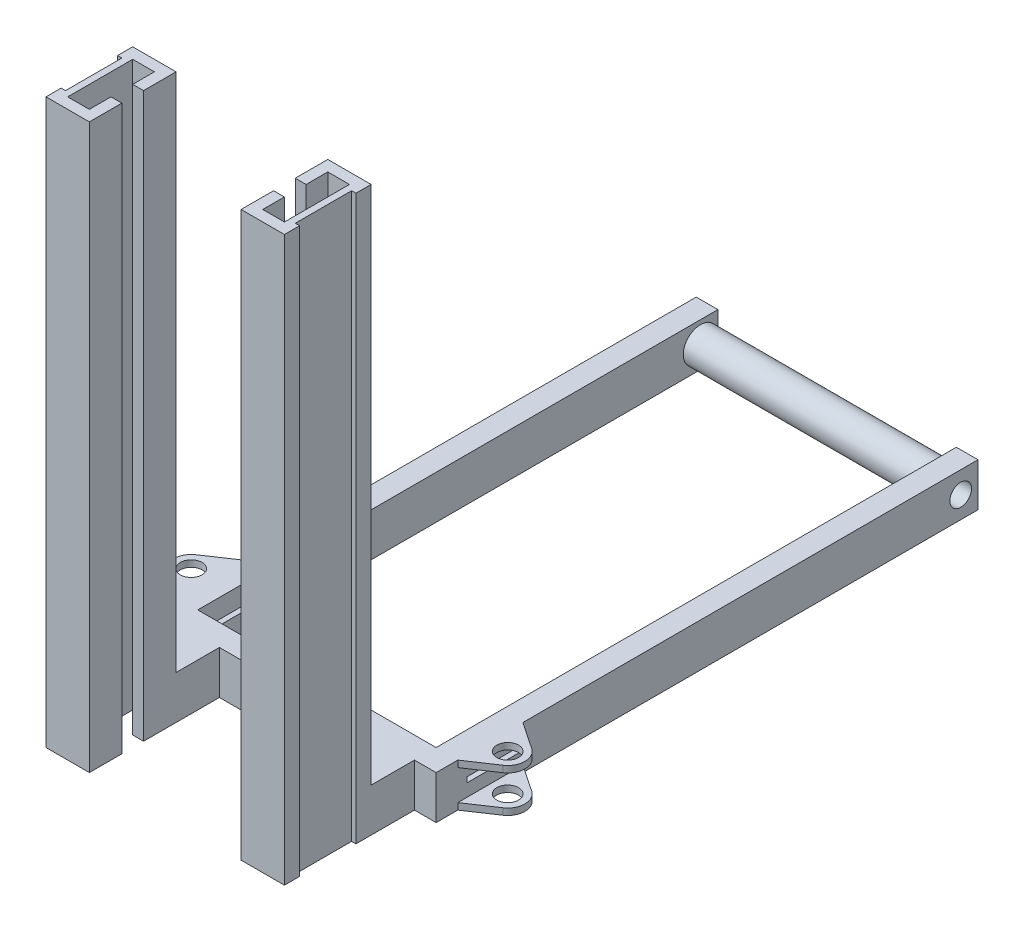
from build123d import *

# Parameters (mm, degrees)
SKETCH_3_W               = 50
SKETCH_3_H               = 1200
EXTRUDE_2_DEPTH          = 100
EXTRUDE_2_2_DEPTH        = 100
SKETCH_5_R               = 40
SKETCH_5_R_2             = 25
EXTRUDE_3_DEPTH          = 550
SKETCH_6_R               = 25
EXTRUDE_4_DEPTH          = 100
CUT_EXTRUDE_START        = 15
SKETCH_6_4_R             = 25
CUT_EXTRUDE_2_DEPTH      = 70
CUT_EXTRUDE_3_DEPTH      = 950
CUT_EXTRUDE_3_DEPTH_BACK = 65
CUT_EXTRUDE_START_2      = -50
SKETCH_11_W              = 50
SKETCH_11_H              = 130.940009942
CUT_EXTRUDE_5_DEPTH      = 6
SKETCH_12_W              = 650
SKETCH_12_H              = 50
EXTRUDE_5_DEPTH          = 100
SKETCH_13_W              = 100
SKETCH_13_H              = 100
EXTRUDE_6_DEPTH          = 100
EXTRUDE_7_DEPTH          = 1300
SKETCH_15_W              = 130
SKETCH_15_H              = 1300
CUT_EXTRUDE_6_DEPTH      = 10


with BuildPart() as part:
    # Sketch 3 → Extrude 2 (new body)
    with BuildSketch(Plane(origin=(0, 0, 0), x_dir=(1, 0, 0), z_dir=(0, 1, 0))):
        with Locations((-300, 0)):
            Rectangle(SKETCH_3_W, SKETCH_3_H)
    extrude(amount=EXTRUDE_2_DEPTH)



with BuildPart() as body_2:
    # Sketch 3 → Extrude 2 2 (new body)
    with BuildSketch(Plane(origin=(0, 0, 0), x_dir=(1, 0, 0), z_dir=(0, 1, 0))):
        with Locations((300, 0)):
            Rectangle(SKETCH_3_W, SKETCH_3_H)
    extrude(amount=EXTRUDE_2_2_DEPTH)


with BuildPart() as part_1:
    add(part.part)

    add(body_2.part)  # Extrude 3 merges body 2
    # Sketch 5 → Extrude 3 (add)
    with BuildSketch(Plane(origin=(-275, 0, 0), x_dir=(0, 0, -1), z_dir=(1, 0, 0))):
        with Locations((560, 50)):
            Circle(SKETCH_5_R)
        with Locations((560, 50)):
            Circle(SKETCH_5_R_2, mode=Mode.SUBTRACT)
    extrude(amount=EXTRUDE_3_DEPTH)

    # Sketch 6 → Extrude 4 (add)
    with BuildSketch(Plane(origin=(0, 0, 0), x_dir=(1, 0, 0), z_dir=(0, 1, 0))):
        with BuildLine():
            Line((-387.283737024, -558.21799308), (-325, -600))
            Line((-325, -600), (-325, -450))
            Line((-325, -450), (-387.283737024, -491.78200692))
            ThreePointArc((-387.283737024, -491.78200692), (-405, -525), (-387.283737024, -558.21799308))
        make_face()
        with Locations(Location((-365, -525, 0), (0, 0, 270))):
            Circle(SKETCH_6_R, mode=Mode.SUBTRACT)
    extrude_4 = extrude(amount=EXTRUDE_4_DEPTH)

    # Sketch 6_4 → Cut-Extrude 2 (cut)
    with BuildSketch(Plane(origin=(0, 0, 0), x_dir=(1, 0, 0), z_dir=(0, 1, 0)).offset(CUT_EXTRUDE_START)):
        with BuildLine():
            Line((-387.283737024, -558.21799308), (-325, -600))
            Line((-325, -600), (-325, -450))
            Line((-325, -450), (-387.283737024, -491.78200692))
            ThreePointArc((-387.283737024, -491.78200692), (-405, -525), (-387.283737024, -558.21799308))
        make_face()
        with Locations(Location((-365, -525, 0), (0, 0, 270))):
            Circle(SKETCH_6_4_R, mode=Mode.SUBTRACT)
    cut_extrude_2 = extrude(amount=CUT_EXTRUDE_2_DEPTH, mode=Mode.SUBTRACT)

    # Mirror 3: Extrude 4, Cut-Extrude 2 across plane
    add(extrude_4.mirror(Plane(origin=(0, 0, 0), x_dir=(0, 0, 1), z_dir=(1, 0, 0))))
    add(cut_extrude_2.mirror(Plane(origin=(0, 0, 0), x_dir=(0, 0, 1), z_dir=(1, 0, 0))), mode=Mode.SUBTRACT)

    # Sketch 5_3 → Cut-Extrude 3 (cut, two sides: drawn at the far end of the back side and taken through both)
    with BuildSketch(Plane(origin=(-275, 0, 0), x_dir=(0, 0, -1), z_dir=(1, 0, 0)).offset(-CUT_EXTRUDE_3_DEPTH_BACK)):
        with BuildLine():
            ThreePointArc((535, 50), (560, 25), (585, 50))
            Line((585, 50), (535, 50))
        make_face()
        with BuildLine():
            Line((535, 50), (585, 50))
            ThreePointArc((585, 50), (560, 75), (535, 50))
        make_face()
        with BuildLine():
            ThreePointArc((535, 50), (560, 25), (585, 50))
            Line((585, 50), (535, 50))
        make_face()
        with BuildLine():
            Line((535, 50), (585, 50))
            ThreePointArc((585, 50), (560, 75), (535, 50))
        make_face()
    extrude(amount=CUT_EXTRUDE_3_DEPTH + CUT_EXTRUDE_3_DEPTH_BACK, mode=Mode.SUBTRACT)

    # Sketch 11 → Cut-Extrude 5 (cut, symmetric)
    with BuildSketch(Plane(origin=(0, 100, 0), x_dir=(1, 0, 0), z_dir=(0, 1, 0)).offset(CUT_EXTRUDE_START_2)):
        with Locations((-300, -512.899423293)):
            Rectangle(SKETCH_11_W, SKETCH_11_H)
    cut_extrude_5 = extrude(amount=CUT_EXTRUDE_5_DEPTH, both=True, mode=Mode.SUBTRACT)

    # Mirror 4: Cut-Extrude 5 across plane
    add(cut_extrude_5.mirror(Plane(origin=(0, 0, 0), x_dir=(0, 0, 1), z_dir=(1, 0, 0))), mode=Mode.SUBTRACT)

    # Sketch 12 → Extrude 5 (add)
    with BuildSketch(Plane(origin=(0, 100, 0), x_dir=(1, 0, 0), z_dir=(0, 1, 0))):
        with Locations((0, -625)):
            Rectangle(SKETCH_12_W, SKETCH_12_H)
    extrude(amount=-EXTRUDE_5_DEPTH)

    # Sketch 13 → Extrude 6 (add)
    with BuildSketch(Plane.XY.offset(650)):
        with Locations((-225, 50)):
            Rectangle(SKETCH_13_W, SKETCH_13_H)
    extrude_6 = extrude(amount=EXTRUDE_6_DEPTH)

    # Mirror 5: Extrude 6 across plane
    add(extrude_6.mirror(Plane(origin=(0, 0, 0), x_dir=(0, 0, 1), z_dir=(1, 0, 0))))

    # Sketch 14 → Extrude 7 (add)
    with BuildSketch(Plane(origin=(0, 0, 0), x_dir=(1, 0, 0), z_dir=(0, 1, 0))):
        Polygon((-175, -750), (-275, -750), (-275, -950), (-175, -950), (-175, -875), (-200, -875), (-200, -925), (-250, -925), (-250, -775), (-200, -775), (-200, -825), (-175, -825), align=None)
    extrude_7 = extrude(amount=EXTRUDE_7_DEPTH)

    # Mirror 6: Extrude 7 across plane
    add(extrude_7.mirror(Plane(origin=(0, 0, 0), x_dir=(0, 0, 1), z_dir=(1, 0, 0))))

    # Sketch 15 → Cut-Extrude 6 (cut)
    with BuildSketch(Plane(origin=(275, 0, 0), x_dir=(0, 0, -1), z_dir=(1, 0, 0))):
        with Locations((-850, 650)):
            Rectangle(SKETCH_15_W, SKETCH_15_H)
    cut_extrude_6 = extrude(amount=-CUT_EXTRUDE_6_DEPTH, mode=Mode.SUBTRACT)

    # Mirror 7: Cut-Extrude 6 across plane
    add(cut_extrude_6.mirror(Plane(origin=(0, 0, 0), x_dir=(0, 0, 1), z_dir=(1, 0, 0))), mode=Mode.SUBTRACT)


solid = part_1.part
